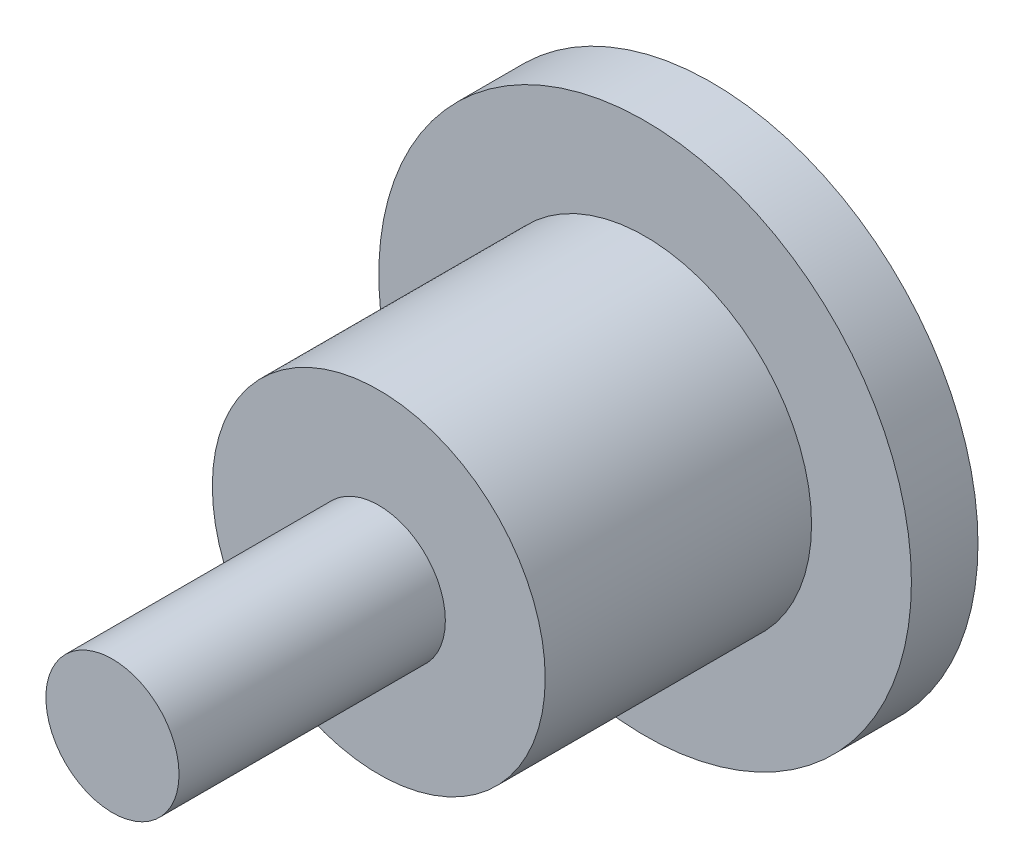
from build123d import *

# Parameters (mm, degrees)
SKETCH_1_R      = 2
EXTRUDE_1_DEPTH = 0.5
SKETCH_2_R      = 1.25
EXTRUDE_2_DEPTH = 2
SKETCH_3_R      = 0.5
EXTRUDE_3_DEPTH = 2


with BuildPart() as part:
    # Sketch 1 → Extrude 1 (new body)
    with BuildSketch(Plane.XY):
        Circle(SKETCH_1_R)
    extrude(amount=EXTRUDE_1_DEPTH)

    # Sketch 2 → Extrude 2 (add)
    with BuildSketch(Plane.XY.offset(0.5)):
        Circle(SKETCH_2_R)
    extrude(amount=EXTRUDE_2_DEPTH)

    # Sketch 3 → Extrude 3 (add)
    with BuildSketch(Plane.XY.offset(2.5)):
        Circle(SKETCH_3_R)
    extrude(amount=EXTRUDE_3_DEPTH)


solid = part.part
